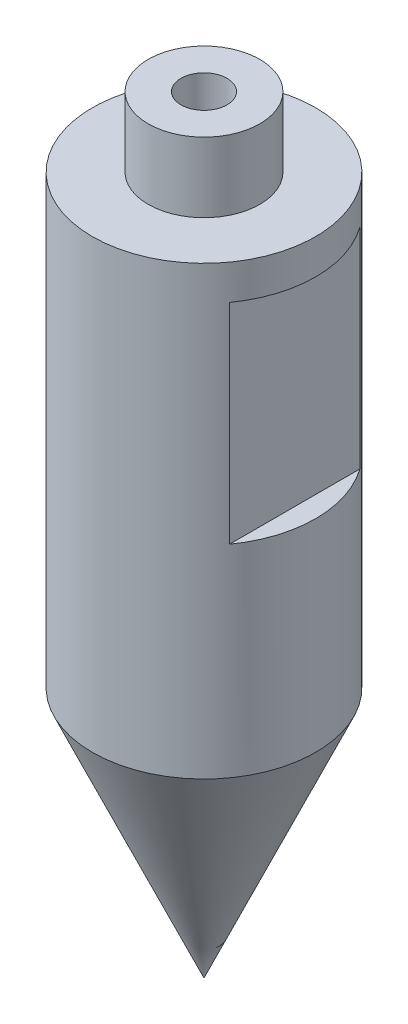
ISO-10303-21;
HEADER;
FILE_DESCRIPTION(('STEP AP214'),'2;1');
FILE_NAME('part.step','',(''),(''),'','','');
FILE_SCHEMA(('AUTOMOTIVE_DESIGN { 1 0 10303 214 1 1 1 1 }'));
ENDSEC;
DATA;
#1=APPLICATION_CONTEXT('core data for automotive mechanical design processes');
#2=APPLICATION_PROTOCOL_DEFINITION('international standard','automotive_design',2000,#1);
#3=PRODUCT_CONTEXT('',#1,'mechanical');
#4=PRODUCT('Part','Part','',(#3));
#5=PRODUCT_RELATED_PRODUCT_CATEGORY('part','',(#4));
#6=PRODUCT_DEFINITION_FORMATION('','',#4);
#7=PRODUCT_DEFINITION_CONTEXT('part definition',#1,'design');
#8=PRODUCT_DEFINITION('design','',#6,#7);
#9=PRODUCT_DEFINITION_SHAPE('','',#8);
#10=(LENGTH_UNIT() NAMED_UNIT(*) SI_UNIT(.MILLI.,.METRE.));
#11=(NAMED_UNIT(*) PLANE_ANGLE_UNIT() SI_UNIT($,.RADIAN.));
#12=(NAMED_UNIT(*) SI_UNIT($,.STERADIAN.) SOLID_ANGLE_UNIT());
#13=UNCERTAINTY_MEASURE_WITH_UNIT(LENGTH_MEASURE(1.E-05),#10,'distance_accuracy_value','');
#14=(GEOMETRIC_REPRESENTATION_CONTEXT(3) GLOBAL_UNCERTAINTY_ASSIGNED_CONTEXT((#13)) GLOBAL_UNIT_ASSIGNED_CONTEXT((#10,
#11,#12)) REPRESENTATION_CONTEXT('',''));
#15=CARTESIAN_POINT('',(0.,0.,0.));
#16=DIRECTION('',(0.,0.,1.));
#17=DIRECTION('',(1.,0.,0.));
#18=AXIS2_PLACEMENT_3D('',#15,#16,#17);
#19=CARTESIAN_POINT('',(0.,0.,0.));
#20=DIRECTION('',(0.,-1.,0.));
#21=DIRECTION('',(0.,0.,-1.));
#22=AXIS2_PLACEMENT_3D('',#19,#20,#21);
#23=PLANE('',#22);
#24=CARTESIAN_POINT('',(0.,0.,0.));
#25=DIRECTION('',(0.,1.,0.));
#26=DIRECTION('',(0.,0.,1.));
#27=AXIS2_PLACEMENT_3D('',#24,#25,#26);
#28=CIRCLE('',#27,4.);
#29=CARTESIAN_POINT('',(0.,0.,4.));
#30=VERTEX_POINT('',#29);
#31=EDGE_CURVE('E112',#30,#30,#28,.T.);
#32=ORIENTED_EDGE('',*,*,#31,.F.);
#33=EDGE_LOOP('',(#32));
#34=FACE_BOUND('',#33,.T.);
#35=CARTESIAN_POINT('',(0.,0.,0.));
#36=DIRECTION('',(0.,-1.,0.));
#37=DIRECTION('',(0.,0.,-1.));
#38=AXIS2_PLACEMENT_3D('',#35,#36,#37);
#39=CIRCLE('',#38,8.);
#40=CARTESIAN_POINT('',(0.,0.,-8.));
#41=VERTEX_POINT('',#40);
#42=EDGE_CURVE('E116',#41,#41,#39,.T.);
#43=ORIENTED_EDGE('',*,*,#42,.F.);
#44=EDGE_LOOP('',(#43));
#45=FACE_BOUND('',#44,.T.);
#46=ADVANCED_FACE('F41',(#34,#45),#23,.F.);
#47=CARTESIAN_POINT('',(0.,-50.,0.));
#48=DIRECTION('',(0.,-1.,0.));
#49=DIRECTION('',(0.,0.,-1.));
#50=AXIS2_PLACEMENT_3D('',#47,#48,#49);
#51=CYLINDRICAL_SURFACE('',#50,8.);
#52=DIRECTION('',(0.,-1.,0.));
#53=VECTOR('',#52,1.);
#54=CARTESIAN_POINT('',(6.50000000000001,-50.,4.66368952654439));
#55=LINE('',#54,#53);
#56=CARTESIAN_POINT('',(6.50000000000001,-17.5,4.6636895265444));
#57=VERTEX_POINT('',#56);
#58=CARTESIAN_POINT('',(6.5,-2.5,4.6636895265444));
#59=VERTEX_POINT('',#58);
#60=EDGE_CURVE('E135',#57,#59,#55,.F.);
#61=ORIENTED_EDGE('',*,*,#60,.T.);
#62=CARTESIAN_POINT('',(0.,-2.5,0.));
#63=DIRECTION('',(0.,1.,0.));
#64=DIRECTION('',(0.,0.,1.));
#65=AXIS2_PLACEMENT_3D('',#62,#63,#64);
#66=CIRCLE('',#65,8.);
#67=CARTESIAN_POINT('',(6.5,-2.5,-4.6636895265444));
#68=VERTEX_POINT('',#67);
#69=EDGE_CURVE('E11',#59,#68,#66,.T.);
#70=ORIENTED_EDGE('',*,*,#69,.T.);
#71=DIRECTION('',(0.,-1.,0.));
#72=VECTOR('',#71,1.);
#73=CARTESIAN_POINT('',(6.50000000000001,-50.,-4.66368952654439));
#74=LINE('',#73,#72);
#75=CARTESIAN_POINT('',(6.50000000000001,-17.5,-4.6636895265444));
#76=VERTEX_POINT('',#75);
#77=EDGE_CURVE('E48',#68,#76,#74,.T.);
#78=ORIENTED_EDGE('',*,*,#77,.T.);
#79=CARTESIAN_POINT('',(0.,-17.5,0.));
#80=DIRECTION('',(0.,-1.,0.));
#81=DIRECTION('',(1.,0.,0.));
#82=AXIS2_PLACEMENT_3D('',#79,#80,#81);
#83=CIRCLE('',#82,8.);
#84=EDGE_CURVE('E132',#76,#57,#83,.T.);
#85=ORIENTED_EDGE('',*,*,#84,.T.);
#86=EDGE_LOOP('',(#61,#70,#78,#85));
#87=FACE_BOUND('',#86,.T.);
#88=CARTESIAN_POINT('',(0.,-2.5,0.));
#89=DIRECTION('',(0.,1.,0.));
#90=DIRECTION('',(-1.,0.,0.));
#91=AXIS2_PLACEMENT_3D('',#88,#89,#90);
#92=CIRCLE('',#91,8.);
#93=CARTESIAN_POINT('',(-6.49999999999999,-2.5,-4.66368952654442));
#94=VERTEX_POINT('',#93);
#95=CARTESIAN_POINT('',(-6.5,-2.5,4.66368952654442));
#96=VERTEX_POINT('',#95);
#97=EDGE_CURVE('E123',#94,#96,#92,.T.);
#98=ORIENTED_EDGE('',*,*,#97,.T.);
#99=DIRECTION('',(0.,-1.,0.));
#100=VECTOR('',#99,1.);
#101=CARTESIAN_POINT('',(-6.49999999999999,-50.,4.66368952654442));
#102=LINE('',#101,#100);
#103=CARTESIAN_POINT('',(-6.49999999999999,-17.5,4.66368952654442));
#104=VERTEX_POINT('',#103);
#105=EDGE_CURVE('E129',#96,#104,#102,.T.);
#106=ORIENTED_EDGE('',*,*,#105,.T.);
#107=CARTESIAN_POINT('',(0.,-17.5,0.));
#108=DIRECTION('',(0.,-1.,0.));
#109=DIRECTION('',(1.,0.,0.));
#110=AXIS2_PLACEMENT_3D('',#107,#108,#109);
#111=CIRCLE('',#110,8.);
#112=CARTESIAN_POINT('',(-6.49999999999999,-17.5,-4.66368952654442));
#113=VERTEX_POINT('',#112);
#114=EDGE_CURVE('E126',#104,#113,#111,.T.);
#115=ORIENTED_EDGE('',*,*,#114,.T.);
#116=DIRECTION('',(0.,-1.,0.));
#117=VECTOR('',#116,1.);
#118=CARTESIAN_POINT('',(-6.49999999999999,-50.,-4.66368952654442));
#119=LINE('',#118,#117);
#120=EDGE_CURVE('E115',#113,#94,#119,.F.);
#121=ORIENTED_EDGE('',*,*,#120,.T.);
#122=EDGE_LOOP('',(#98,#106,#115,#121));
#123=FACE_BOUND('',#122,.T.);
#124=CARTESIAN_POINT('',(0.,-32.,0.));
#125=DIRECTION('',(0.,-1.,0.));
#126=DIRECTION('',(0.,0.,-1.));
#127=AXIS2_PLACEMENT_3D('',#124,#125,#126);
#128=CIRCLE('',#127,8.);
#129=CARTESIAN_POINT('',(0.,-32.,-8.));
#130=VERTEX_POINT('',#129);
#131=EDGE_CURVE('E111',#130,#130,#128,.T.);
#132=ORIENTED_EDGE('',*,*,#131,.F.);
#133=EDGE_LOOP('',(#132));
#134=FACE_BOUND('',#133,.T.);
#135=ORIENTED_EDGE('',*,*,#42,.T.);
#136=EDGE_LOOP('',(#135));
#137=FACE_BOUND('',#136,.T.);
#138=ADVANCED_FACE('F139',(#87,#123,#134,#137),#51,.T.);
#139=CARTESIAN_POINT('',(0.,-32.,0.));
#140=DIRECTION('',(0.,1.,0.));
#141=DIRECTION('',(0.,0.,1.));
#142=AXIS2_PLACEMENT_3D('',#139,#140,#141);
#143=CONICAL_SURFACE('',#142,8.,0.418224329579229);
#144=CARTESIAN_POINT('',(0.,-50.,0.));
#145=VERTEX_POINT('',#144);
#146=VERTEX_LOOP('',#145);
#147=FACE_BOUND('',#146,.T.);
#148=ORIENTED_EDGE('',*,*,#131,.T.);
#149=EDGE_LOOP('',(#148));
#150=FACE_BOUND('',#149,.T.);
#151=ADVANCED_FACE('F160',(#147,#150),#143,.T.);
#152=CARTESIAN_POINT('',(0.,5.,0.));
#153=DIRECTION('',(0.,-1.,0.));
#154=DIRECTION('',(0.,0.,-1.));
#155=AXIS2_PLACEMENT_3D('',#152,#153,#154);
#156=CYLINDRICAL_SURFACE('',#155,4.);
#157=CARTESIAN_POINT('',(0.,5.,0.));
#158=DIRECTION('',(0.,1.,0.));
#159=DIRECTION('',(0.,0.,1.));
#160=AXIS2_PLACEMENT_3D('',#157,#158,#159);
#161=CIRCLE('',#160,4.);
#162=CARTESIAN_POINT('',(0.,5.,4.));
#163=VERTEX_POINT('',#162);
#164=EDGE_CURVE('E106',#163,#163,#161,.T.);
#165=ORIENTED_EDGE('',*,*,#164,.F.);
#166=EDGE_LOOP('',(#165));
#167=FACE_BOUND('',#166,.T.);
#168=ORIENTED_EDGE('',*,*,#31,.T.);
#169=EDGE_LOOP('',(#168));
#170=FACE_BOUND('',#169,.T.);
#171=ADVANCED_FACE('F166',(#167,#170),#156,.T.);
#172=CARTESIAN_POINT('',(0.,5.,0.));
#173=DIRECTION('',(0.,1.,0.));
#174=DIRECTION('',(0.,0.,1.));
#175=AXIS2_PLACEMENT_3D('',#172,#173,#174);
#176=PLANE('',#175);
#177=CARTESIAN_POINT('',(0.,5.,0.));
#178=DIRECTION('',(0.,1.,0.));
#179=DIRECTION('',(0.,0.,1.));
#180=AXIS2_PLACEMENT_3D('',#177,#178,#179);
#181=CIRCLE('',#180,1.65);
#182=CARTESIAN_POINT('',(0.,5.,1.65));
#183=VERTEX_POINT('',#182);
#184=EDGE_CURVE('E96',#183,#183,#181,.T.);
#185=ORIENTED_EDGE('',*,*,#184,.F.);
#186=EDGE_LOOP('',(#185));
#187=FACE_BOUND('',#186,.T.);
#188=ORIENTED_EDGE('',*,*,#164,.T.);
#189=EDGE_LOOP('',(#188));
#190=FACE_BOUND('',#189,.T.);
#191=ADVANCED_FACE('F168',(#187,#190),#176,.T.);
#192=CARTESIAN_POINT('',(-6.49999999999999,-17.5,-8.));
#193=DIRECTION('',(0.,-1.,0.));
#194=DIRECTION('',(1.,0.,0.));
#195=AXIS2_PLACEMENT_3D('',#192,#193,#194);
#196=PLANE('',#195);
#197=DIRECTION('',(0.,0.,1.));
#198=VECTOR('',#197,1.);
#199=CARTESIAN_POINT('',(-6.49999999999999,-17.5,-8.));
#200=LINE('',#199,#198);
#201=EDGE_CURVE('E95',#113,#104,#200,.T.);
#202=ORIENTED_EDGE('',*,*,#201,.F.);
#203=ORIENTED_EDGE('',*,*,#114,.F.);
#204=EDGE_LOOP('',(#202,#203));
#205=FACE_BOUND('',#204,.T.);
#206=ADVANCED_FACE('F175',(#205),#196,.F.);
#207=CARTESIAN_POINT('',(-6.5,-2.5,-8.));
#208=DIRECTION('',(0.,1.,0.));
#209=DIRECTION('',(-1.,0.,0.));
#210=AXIS2_PLACEMENT_3D('',#207,#208,#209);
#211=PLANE('',#210);
#212=DIRECTION('',(0.,0.,1.));
#213=VECTOR('',#212,1.);
#214=CARTESIAN_POINT('',(-6.5,-2.5,-8.));
#215=LINE('',#214,#213);
#216=EDGE_CURVE('E62',#94,#96,#215,.T.);
#217=ORIENTED_EDGE('',*,*,#216,.T.);
#218=ORIENTED_EDGE('',*,*,#97,.F.);
#219=EDGE_LOOP('',(#217,#218));
#220=FACE_BOUND('',#219,.T.);
#221=ADVANCED_FACE('F184',(#220),#211,.F.);
#222=CARTESIAN_POINT('',(-6.5,-2.5,-8.));
#223=DIRECTION('',(1.,0.,0.));
#224=DIRECTION('',(0.,1.,0.));
#225=AXIS2_PLACEMENT_3D('',#222,#223,#224);
#226=PLANE('',#225);
#227=ORIENTED_EDGE('',*,*,#216,.F.);
#228=ORIENTED_EDGE('',*,*,#120,.F.);
#229=ORIENTED_EDGE('',*,*,#201,.T.);
#230=ORIENTED_EDGE('',*,*,#105,.F.);
#231=EDGE_LOOP('',(#227,#228,#229,#230));
#232=FACE_BOUND('',#231,.T.);
#233=ADVANCED_FACE('F153',(#232),#226,.F.);
#234=CARTESIAN_POINT('',(6.5,-2.5,-8.));
#235=DIRECTION('',(-1.,0.,0.));
#236=DIRECTION('',(0.,-1.,0.));
#237=AXIS2_PLACEMENT_3D('',#234,#235,#236);
#238=PLANE('',#237);
#239=DIRECTION('',(0.,0.,1.));
#240=VECTOR('',#239,1.);
#241=CARTESIAN_POINT('',(6.5,-2.5,-8.));
#242=LINE('',#241,#240);
#243=EDGE_CURVE('E103',#68,#59,#242,.T.);
#244=ORIENTED_EDGE('',*,*,#243,.T.);
#245=ORIENTED_EDGE('',*,*,#60,.F.);
#246=DIRECTION('',(0.,0.,1.));
#247=VECTOR('',#246,1.);
#248=CARTESIAN_POINT('',(6.50000000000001,-17.5,-8.));
#249=LINE('',#248,#247);
#250=EDGE_CURVE('E54',#76,#57,#249,.T.);
#251=ORIENTED_EDGE('',*,*,#250,.F.);
#252=ORIENTED_EDGE('',*,*,#77,.F.);
#253=EDGE_LOOP('',(#244,#245,#251,#252));
#254=FACE_BOUND('',#253,.T.);
#255=ADVANCED_FACE('F143',(#254),#238,.F.);
#256=CARTESIAN_POINT('',(6.5,-2.5,-8.));
#257=DIRECTION('',(0.,1.,0.));
#258=DIRECTION('',(0.,0.,1.));
#259=AXIS2_PLACEMENT_3D('',#256,#257,#258);
#260=PLANE('',#259);
#261=ORIENTED_EDGE('',*,*,#243,.F.);
#262=ORIENTED_EDGE('',*,*,#69,.F.);
#263=EDGE_LOOP('',(#261,#262));
#264=FACE_BOUND('',#263,.T.);
#265=ADVANCED_FACE('F145',(#264),#260,.F.);
#266=CARTESIAN_POINT('',(6.50000000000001,-17.5,-8.));
#267=DIRECTION('',(0.,-1.,0.));
#268=DIRECTION('',(1.,0.,0.));
#269=AXIS2_PLACEMENT_3D('',#266,#267,#268);
#270=PLANE('',#269);
#271=ORIENTED_EDGE('',*,*,#250,.T.);
#272=ORIENTED_EDGE('',*,*,#84,.F.);
#273=EDGE_LOOP('',(#271,#272));
#274=FACE_BOUND('',#273,.T.);
#275=ADVANCED_FACE('F89',(#274),#270,.F.);
#276=CARTESIAN_POINT('',(0.,-5.1,0.));
#277=DIRECTION('',(0.,1.,0.));
#278=DIRECTION('',(0.,0.,1.));
#279=AXIS2_PLACEMENT_3D('',#276,#277,#278);
#280=CONICAL_SURFACE('',#279,1.65,1.02974425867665);
#281=CARTESIAN_POINT('',(0.,-6.09142002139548,0.));
#282=VERTEX_POINT('',#281);
#283=VERTEX_LOOP('',#282);
#284=FACE_BOUND('',#283,.T.);
#285=CARTESIAN_POINT('',(0.,-5.1,0.));
#286=DIRECTION('',(0.,1.,0.));
#287=DIRECTION('',(0.,0.,1.));
#288=AXIS2_PLACEMENT_3D('',#285,#286,#287);
#289=CIRCLE('',#288,1.65);
#290=CARTESIAN_POINT('',(0.,-5.1,1.65));
#291=VERTEX_POINT('',#290);
#292=EDGE_CURVE('E93',#291,#291,#289,.T.);
#293=ORIENTED_EDGE('',*,*,#292,.T.);
#294=EDGE_LOOP('',(#293));
#295=FACE_BOUND('',#294,.T.);
#296=ADVANCED_FACE('F85',(#284,#295),#280,.F.);
#297=CARTESIAN_POINT('',(0.,5.,0.));
#298=DIRECTION('',(0.,1.,0.));
#299=DIRECTION('',(0.,0.,1.));
#300=AXIS2_PLACEMENT_3D('',#297,#298,#299);
#301=CYLINDRICAL_SURFACE('',#300,1.65);
#302=ORIENTED_EDGE('',*,*,#292,.F.);
#303=EDGE_LOOP('',(#302));
#304=FACE_BOUND('',#303,.T.);
#305=ORIENTED_EDGE('',*,*,#184,.T.);
#306=EDGE_LOOP('',(#305));
#307=FACE_BOUND('',#306,.T.);
#308=ADVANCED_FACE('F88',(#304,#307),#301,.F.);
#309=CLOSED_SHELL('',(#46,#138,#151,#171,#191,#206,#221,#233,#255,#265,#275,#296,#308));
#310=MANIFOLD_SOLID_BREP('B2',#309);
#311=ADVANCED_BREP_SHAPE_REPRESENTATION('',(#18,#310),#14);
#312=SHAPE_DEFINITION_REPRESENTATION(#9,#311);
ENDSEC;
END-ISO-10303-21;
